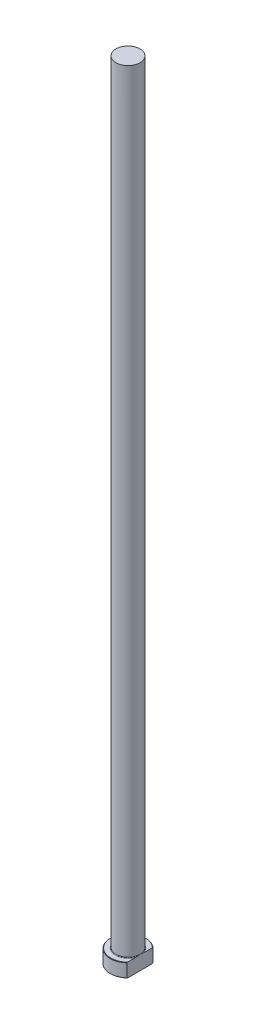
ISO-10303-21;
HEADER;
FILE_DESCRIPTION(('STEP AP214'),'2;1');
FILE_NAME('part.step','',(''),(''),'','','');
FILE_SCHEMA(('AUTOMOTIVE_DESIGN { 1 0 10303 214 1 1 1 1 }'));
ENDSEC;
DATA;
#1=APPLICATION_CONTEXT('core data for automotive mechanical design processes');
#2=APPLICATION_PROTOCOL_DEFINITION('international standard','automotive_design',2000,#1);
#3=PRODUCT_CONTEXT('',#1,'mechanical');
#4=PRODUCT('Part','Part','',(#3));
#5=PRODUCT_RELATED_PRODUCT_CATEGORY('part','',(#4));
#6=PRODUCT_DEFINITION_FORMATION('','',#4);
#7=PRODUCT_DEFINITION_CONTEXT('part definition',#1,'design');
#8=PRODUCT_DEFINITION('design','',#6,#7);
#9=PRODUCT_DEFINITION_SHAPE('','',#8);
#10=(LENGTH_UNIT() NAMED_UNIT(*) SI_UNIT(.MILLI.,.METRE.));
#11=(NAMED_UNIT(*) PLANE_ANGLE_UNIT() SI_UNIT($,.RADIAN.));
#12=(NAMED_UNIT(*) SI_UNIT($,.STERADIAN.) SOLID_ANGLE_UNIT());
#13=UNCERTAINTY_MEASURE_WITH_UNIT(LENGTH_MEASURE(1.E-05),#10,'distance_accuracy_value','');
#14=(GEOMETRIC_REPRESENTATION_CONTEXT(3) GLOBAL_UNCERTAINTY_ASSIGNED_CONTEXT((#13)) GLOBAL_UNIT_ASSIGNED_CONTEXT((#10,
#11,#12)) REPRESENTATION_CONTEXT('',''));
#15=CARTESIAN_POINT('',(0.,0.,0.));
#16=DIRECTION('',(0.,0.,1.));
#17=DIRECTION('',(1.,0.,0.));
#18=AXIS2_PLACEMENT_3D('',#15,#16,#17);
#19=CARTESIAN_POINT('',(0.,0.,0.));
#20=DIRECTION('',(0.,-1.,0.));
#21=DIRECTION('',(0.,0.,-1.));
#22=AXIS2_PLACEMENT_3D('',#19,#20,#21);
#23=PLANE('',#22);
#24=CARTESIAN_POINT('',(0.,0.,0.));
#25=DIRECTION('',(0.,-1.,0.));
#26=DIRECTION('',(0.,0.,-1.));
#27=AXIS2_PLACEMENT_3D('',#24,#25,#26);
#28=CIRCLE('',#27,8.79999999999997);
#29=CARTESIAN_POINT('',(6.09999999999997,0.,6.34271235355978));
#30=VERTEX_POINT('',#29);
#31=CARTESIAN_POINT('',(6.09999999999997,0.,-6.34271235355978));
#32=VERTEX_POINT('',#31);
#33=EDGE_CURVE('E98',#30,#32,#28,.T.);
#34=ORIENTED_EDGE('',*,*,#33,.T.);
#35=DIRECTION('',(0.,0.,1.));
#36=VECTOR('',#35,1.);
#37=CARTESIAN_POINT('',(6.09999999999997,0.,-6.61740130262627));
#38=LINE('',#37,#36);
#39=EDGE_CURVE('E83',#32,#30,#38,.T.);
#40=ORIENTED_EDGE('',*,*,#39,.T.);
#41=EDGE_LOOP('',(#34,#40));
#42=FACE_BOUND('',#41,.T.);
#43=ADVANCED_FACE('F32',(#42),#23,.T.);
#44=CARTESIAN_POINT('',(0.,259.958771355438,0.));
#45=DIRECTION('',(0.,1.,0.));
#46=DIRECTION('',(0.,0.,1.));
#47=AXIS2_PLACEMENT_3D('',#44,#45,#46);
#48=CYLINDRICAL_SURFACE('',#47,8.99999999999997);
#49=CARTESIAN_POINT('',(0.,6.79999999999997,0.));
#50=DIRECTION('',(0.,1.,0.));
#51=DIRECTION('',(0.,0.,1.));
#52=AXIS2_PLACEMENT_3D('',#49,#50,#51);
#53=CIRCLE('',#52,8.99999999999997);
#54=CARTESIAN_POINT('',(6.09999999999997,6.79999999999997,6.61740130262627));
#55=VERTEX_POINT('',#54);
#56=CARTESIAN_POINT('',(6.09999999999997,6.79999999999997,-6.61740130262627));
#57=VERTEX_POINT('',#56);
#58=EDGE_CURVE('E104',#55,#57,#53,.F.);
#59=ORIENTED_EDGE('',*,*,#58,.T.);
#60=DIRECTION('',(0.,-1.,0.));
#61=VECTOR('',#60,1.);
#62=CARTESIAN_POINT('',(6.09999999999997,400.,-6.61740130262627));
#63=LINE('',#62,#61);
#64=CARTESIAN_POINT('',(6.09999999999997,0.200000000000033,-6.61740130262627));
#65=VERTEX_POINT('',#64);
#66=EDGE_CURVE('E183',#57,#65,#63,.T.);
#67=ORIENTED_EDGE('',*,*,#66,.T.);
#68=CARTESIAN_POINT('',(0.,0.200000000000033,0.));
#69=DIRECTION('',(0.,-1.,0.));
#70=DIRECTION('',(0.,0.,-1.));
#71=AXIS2_PLACEMENT_3D('',#68,#69,#70);
#72=CIRCLE('',#71,8.99999999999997);
#73=CARTESIAN_POINT('',(6.09999999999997,0.200000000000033,6.61740130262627));
#74=VERTEX_POINT('',#73);
#75=EDGE_CURVE('E100',#65,#74,#72,.F.);
#76=ORIENTED_EDGE('',*,*,#75,.T.);
#77=DIRECTION('',(0.,-1.,0.));
#78=VECTOR('',#77,1.);
#79=CARTESIAN_POINT('',(6.09999999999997,400.,6.61740130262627));
#80=LINE('',#79,#78);
#81=EDGE_CURVE('E93',#55,#74,#80,.T.);
#82=ORIENTED_EDGE('',*,*,#81,.F.);
#83=EDGE_LOOP('',(#59,#67,#76,#82));
#84=FACE_BOUND('',#83,.T.);
#85=ADVANCED_FACE('F158',(#84),#48,.T.);
#86=CARTESIAN_POINT('',(-8.99999999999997,7.,0.));
#87=DIRECTION('',(0.,1.,0.));
#88=DIRECTION('',(0.,0.,1.));
#89=AXIS2_PLACEMENT_3D('',#86,#87,#88);
#90=PLANE('',#89);
#91=CARTESIAN_POINT('',(0.,7.,0.));
#92=DIRECTION('',(0.,1.,0.));
#93=DIRECTION('',(0.,0.,1.));
#94=AXIS2_PLACEMENT_3D('',#91,#92,#93);
#95=CIRCLE('',#94,8.79999999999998);
#96=CARTESIAN_POINT('',(6.09999999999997,7.,-6.3427123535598));
#97=VERTEX_POINT('',#96);
#98=CARTESIAN_POINT('',(6.09999999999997,7.,6.3427123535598));
#99=VERTEX_POINT('',#98);
#100=EDGE_CURVE('E178',#97,#99,#95,.T.);
#101=ORIENTED_EDGE('',*,*,#100,.T.);
#102=DIRECTION('',(0.,0.,-1.));
#103=VECTOR('',#102,1.);
#104=CARTESIAN_POINT('',(6.09999999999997,7.,0.));
#105=LINE('',#104,#103);
#106=CARTESIAN_POINT('',(6.09999999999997,6.99999999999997,1.9364916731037));
#107=VERTEX_POINT('',#106);
#108=EDGE_CURVE('E57',#99,#107,#105,.T.);
#109=ORIENTED_EDGE('',*,*,#108,.T.);
#110=CARTESIAN_POINT('',(0.,7.,0.));
#111=DIRECTION('',(0.,1.,0.));
#112=DIRECTION('',(0.,0.,1.));
#113=AXIS2_PLACEMENT_3D('',#110,#111,#112);
#114=CIRCLE('',#113,6.39999999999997);
#115=CARTESIAN_POINT('',(6.09999999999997,6.99999999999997,-1.9364916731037));
#116=VERTEX_POINT('',#115);
#117=EDGE_CURVE('E107',#107,#116,#114,.F.);
#118=ORIENTED_EDGE('',*,*,#117,.T.);
#119=EDGE_CURVE('E136',#116,#97,#105,.T.);
#120=ORIENTED_EDGE('',*,*,#119,.T.);
#121=EDGE_LOOP('',(#101,#109,#118,#120));
#122=FACE_BOUND('',#121,.T.);
#123=ADVANCED_FACE('F147',(#122),#90,.T.);
#124=CARTESIAN_POINT('',(0.,7.00000000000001,0.));
#125=DIRECTION('',(0.,-1.,0.));
#126=DIRECTION('',(0.,0.,-1.));
#127=AXIS2_PLACEMENT_3D('',#124,#125,#126);
#128=CONICAL_SURFACE('',#127,8.79999999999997,0.785398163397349);
#129=ORIENTED_EDGE('',*,*,#58,.F.);
#130=CARTESIAN_POINT('',(6.09999999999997,0.014379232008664,14.5593895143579));
#131=CARTESIAN_POINT('',(6.09999999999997,0.214324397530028,14.3426005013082));
#132=CARTESIAN_POINT('',(6.09999999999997,0.413913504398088,14.125483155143));
#133=CARTESIAN_POINT('',(6.09999999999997,0.812271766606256,13.6904946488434));
#134=CARTESIAN_POINT('',(6.09999999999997,1.01104091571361,13.4726234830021));
#135=CARTESIAN_POINT('',(6.09999999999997,1.60603894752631,12.817642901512));
#136=CARTESIAN_POINT('',(6.09999999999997,2.00087078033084,12.3792612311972));
#137=CARTESIAN_POINT('',(6.09999999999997,2.78792222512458,11.4954287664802));
#138=CARTESIAN_POINT('',(6.09999999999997,3.18011200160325,11.049951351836));
#139=CARTESIAN_POINT('',(6.09999999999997,3.95753447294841,10.1530375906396));
#140=CARTESIAN_POINT('',(6.09999999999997,4.3427679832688,9.70160195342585));
#141=CARTESIAN_POINT('',(6.09999999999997,5.03085646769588,8.87725822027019));
#142=CARTESIAN_POINT('',(6.09999999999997,5.33541849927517,8.50578180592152));
#143=CARTESIAN_POINT('',(6.09999999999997,5.78551221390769,7.94308202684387));
#144=CARTESIAN_POINT('',(6.09999999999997,5.93443884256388,7.75457459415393));
#145=CARTESIAN_POINT('',(6.09999999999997,6.22957503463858,7.37544710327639));
#146=CARTESIAN_POINT('',(6.09999999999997,6.37578465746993,7.18482709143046));
#147=CARTESIAN_POINT('',(6.09999999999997,6.66478900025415,6.80131984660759));
#148=CARTESIAN_POINT('',(6.09999999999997,6.80758709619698,6.60843516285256));
#149=CARTESIAN_POINT('',(6.09999999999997,7.08920912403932,6.21979246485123));
#150=CARTESIAN_POINT('',(6.09999999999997,7.22803324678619,6.02403458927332));
#151=CARTESIAN_POINT('',(6.09999999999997,7.50074563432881,5.62920968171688));
#152=CARTESIAN_POINT('',(6.09999999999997,7.63463576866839,5.4301439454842));
#153=CARTESIAN_POINT('',(6.09999999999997,7.89632379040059,5.02806147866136));
#154=CARTESIAN_POINT('',(6.09999999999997,8.02412236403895,4.82504519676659));
#155=CARTESIAN_POINT('',(6.09999999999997,8.27075787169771,4.41652900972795));
#156=CARTESIAN_POINT('',(6.09999999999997,8.38967506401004,4.21107783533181));
#157=CARTESIAN_POINT('',(6.09999999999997,8.61801299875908,3.79489291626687));
#158=CARTESIAN_POINT('',(6.09999999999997,8.72743269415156,3.58415859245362));
#159=CARTESIAN_POINT('',(6.09999999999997,8.93404173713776,3.15694629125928));
#160=CARTESIAN_POINT('',(6.09999999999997,9.03124152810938,2.94047341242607));
#161=CARTESIAN_POINT('',(6.09999999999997,9.21017577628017,2.50119284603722));
#162=CARTESIAN_POINT('',(6.09999999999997,9.29191471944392,2.27838701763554));
#163=CARTESIAN_POINT('',(6.09999999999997,9.4203870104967,1.8755185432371));
#164=CARTESIAN_POINT('',(6.09999999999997,9.47086768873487,1.69665770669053));
#165=CARTESIAN_POINT('',(6.09999999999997,9.55795989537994,1.33556522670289));
#166=CARTESIAN_POINT('',(6.09999999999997,9.5945732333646,1.15333402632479));
#167=CARTESIAN_POINT('',(6.09999999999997,9.65210004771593,0.786944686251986));
#168=CARTESIAN_POINT('',(6.09999999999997,9.6730611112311,0.602794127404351));
#169=CARTESIAN_POINT('',(6.09999999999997,9.6983198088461,0.233342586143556));
#170=CARTESIAN_POINT('',(6.09999999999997,9.70261818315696,0.0480416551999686));
#171=CARTESIAN_POINT('',(6.09999999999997,9.69429534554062,-0.322485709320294));
#172=CARTESIAN_POINT('',(6.09999999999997,9.68164564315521,-0.507711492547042));
#173=CARTESIAN_POINT('',(6.09999999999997,9.64009976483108,-0.876317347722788));
#174=CARTESIAN_POINT('',(6.09999999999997,9.61120224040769,-1.05969726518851));
#175=CARTESIAN_POINT('',(6.09999999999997,9.53854055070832,-1.42403078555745));
#176=CARTESIAN_POINT('',(6.09999999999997,9.49473105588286,-1.60497522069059));
#177=CARTESIAN_POINT('',(6.09999999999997,9.39417906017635,-1.9631904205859));
#178=CARTESIAN_POINT('',(6.09999999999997,9.3374362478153,-2.14046109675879));
#179=CARTESIAN_POINT('',(6.09999999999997,9.20325707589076,-2.51852539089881));
#180=CARTESIAN_POINT('',(6.09999999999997,9.12397188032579,-2.71865799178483));
#181=CARTESIAN_POINT('',(6.09999999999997,8.95352574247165,-3.11384323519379));
#182=CARTESIAN_POINT('',(6.09999999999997,8.86235948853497,-3.30889355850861));
#183=CARTESIAN_POINT('',(6.09999999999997,8.67035859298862,-3.69456420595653));
#184=CARTESIAN_POINT('',(6.09999999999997,8.56950736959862,-3.88517621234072));
#185=CARTESIAN_POINT('',(6.09999999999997,8.36017703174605,-4.26210307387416));
#186=CARTESIAN_POINT('',(6.09999999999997,8.25169895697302,-4.44841851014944));
#187=CARTESIAN_POINT('',(6.09999999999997,8.02723055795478,-4.81954803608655));
#188=CARTESIAN_POINT('',(6.09999999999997,7.91116499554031,-5.00431640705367));
#189=CARTESIAN_POINT('',(6.09999999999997,7.67391977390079,-5.3705334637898));
#190=CARTESIAN_POINT('',(6.09999999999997,7.5527399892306,-5.55198206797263));
#191=CARTESIAN_POINT('',(6.09999999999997,7.30632827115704,-5.9118216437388));
#192=CARTESIAN_POINT('',(6.09999999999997,7.18110067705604,-6.09021559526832));
#193=CARTESIAN_POINT('',(6.09999999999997,6.92719024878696,-6.44453156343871));
#194=CARTESIAN_POINT('',(6.09999999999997,6.79850727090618,-6.62045347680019));
#195=CARTESIAN_POINT('',(6.09999999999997,6.40743139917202,-7.14601004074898));
#196=CARTESIAN_POINT('',(6.09999999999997,6.14071269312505,-7.49242581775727));
#197=CARTESIAN_POINT('',(6.09999999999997,5.59909026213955,-8.17880344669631));
#198=CARTESIAN_POINT('',(6.09999999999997,5.32418574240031,-8.51876466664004));
#199=CARTESIAN_POINT('',(6.09999999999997,4.76812622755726,-9.19396082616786));
#200=CARTESIAN_POINT('',(6.09999999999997,4.48696661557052,-9.52919195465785));
#201=CARTESIAN_POINT('',(6.09999999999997,3.92006700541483,-10.1957589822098));
#202=CARTESIAN_POINT('',(6.09999999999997,3.63432692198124,-10.527094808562));
#203=CARTESIAN_POINT('',(6.09999999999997,3.07379660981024,-11.1700382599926));
#204=CARTESIAN_POINT('',(6.09999999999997,2.79918078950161,-11.48179819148));
#205=CARTESIAN_POINT('',(6.09999999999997,2.24738477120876,-12.1030461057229));
#206=CARTESIAN_POINT('',(6.09999999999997,1.97020453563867,-12.412534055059));
#207=CARTESIAN_POINT('',(6.09999999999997,1.41421579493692,-13.0291430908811));
#208=CARTESIAN_POINT('',(6.09999999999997,1.13541061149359,-13.3362671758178));
#209=CARTESIAN_POINT('',(6.09999999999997,0.576091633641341,-13.9489357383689));
#210=CARTESIAN_POINT('',(6.09999999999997,0.295577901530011,-14.2544802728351));
#211=CARTESIAN_POINT('',(6.09999999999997,0.014379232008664,-14.5593895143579));
#212=B_SPLINE_CURVE_WITH_KNOTS('',3,(#130,#131,#132,#133,#134,#135,#136,#137,#138,#139,#140,
#141,#142,#143,#144,#145,#146,#147,#148,#149,#150,#151,#152,#153,#154,#155,#156,#157,#158,#159,
#160,#161,#162,#163,#164,#165,#166,#167,#168,#169,#170,#171,#172,#173,#174,#175,#176,#177,#178,
#179,#180,#181,#182,#183,#184,#185,#186,#187,#188,#189,#190,#191,#192,#193,#194,#195,#196,#197,
#198,#199,#200,#201,#202,#203,#204,#205,#206,#207,#208,#209,#210,#211),.UNSPECIFIED.,.F.,.F.,(4,
2,2,2,2,2,2,2,2,2,2,2,2,2,2,2,2,2,2,2,2,2,2,2,2,2,2,2,2,2,2,2,2,2,2,2,2,2,2,2,4),(0.,
0.884747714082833,1.76950214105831,3.53939834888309,5.31990146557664,7.10019448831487,
8.54118050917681,9.26187437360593,9.982552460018,10.7024850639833,11.4223830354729,
12.1420053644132,12.8615464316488,13.5735035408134,14.2855390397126,14.9969618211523,
15.7081778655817,16.2652530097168,16.8222554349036,17.3775574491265,17.9328347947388,
18.4890467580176,19.0453048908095,19.60326927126,20.1612470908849,20.806558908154,
21.4521602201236,22.0988872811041,22.7455263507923,23.4000191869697,24.0545280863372,
24.708357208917,25.3622135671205,26.673612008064,27.9851381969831,29.2976668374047,
30.6102199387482,31.8565868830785,33.102972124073,34.3473597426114,35.5917022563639),.UNSPECIFIED.);
#213=EDGE_CURVE('E135',#55,#99,#212,.T.);
#214=ORIENTED_EDGE('',*,*,#213,.T.);
#215=ORIENTED_EDGE('',*,*,#100,.F.);
#216=EDGE_CURVE('E127',#97,#57,#212,.T.);
#217=ORIENTED_EDGE('',*,*,#216,.T.);
#218=EDGE_LOOP('',(#129,#214,#215,#217));
#219=FACE_BOUND('',#218,.T.);
#220=ADVANCED_FACE('F143',(#219),#128,.T.);
#221=CARTESIAN_POINT('',(0.,0.200000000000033,0.));
#222=DIRECTION('',(0.,1.,0.));
#223=DIRECTION('',(0.,0.,1.));
#224=AXIS2_PLACEMENT_3D('',#221,#222,#223);
#225=CONICAL_SURFACE('',#224,8.99999999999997,0.785398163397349);
#226=ORIENTED_EDGE('',*,*,#75,.F.);
#227=CARTESIAN_POINT('',(6.09999999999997,6.98562076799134,-14.5593895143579));
#228=CARTESIAN_POINT('',(6.09999999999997,6.78567560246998,-14.3426005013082));
#229=CARTESIAN_POINT('',(6.09999999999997,6.58608649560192,-14.125483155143));
#230=CARTESIAN_POINT('',(6.09999999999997,6.18772823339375,-13.6904946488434));
#231=CARTESIAN_POINT('',(6.09999999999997,5.9889590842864,-13.4726234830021));
#232=CARTESIAN_POINT('',(6.09999999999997,5.3939610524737,-12.817642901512));
#233=CARTESIAN_POINT('',(6.09999999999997,4.99912921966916,-12.3792612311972));
#234=CARTESIAN_POINT('',(6.09999999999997,4.21207777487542,-11.4954287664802));
#235=CARTESIAN_POINT('',(6.09999999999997,3.81988799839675,-11.049951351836));
#236=CARTESIAN_POINT('',(6.09999999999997,3.0424655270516,-10.1530375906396));
#237=CARTESIAN_POINT('',(6.09999999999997,2.6572320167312,-9.70160195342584));
#238=CARTESIAN_POINT('',(6.09999999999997,1.96914353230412,-8.87725822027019));
#239=CARTESIAN_POINT('',(6.09999999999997,1.66458150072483,-8.50578180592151));
#240=CARTESIAN_POINT('',(6.09999999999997,1.2144877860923,-7.94308202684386));
#241=CARTESIAN_POINT('',(6.09999999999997,1.06556115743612,-7.75457459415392));
#242=CARTESIAN_POINT('',(6.09999999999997,0.770424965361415,-7.37544710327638));
#243=CARTESIAN_POINT('',(6.09999999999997,0.624215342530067,-7.18482709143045));
#244=CARTESIAN_POINT('',(6.09999999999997,0.335210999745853,-6.80131984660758));
#245=CARTESIAN_POINT('',(6.09999999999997,0.192412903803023,-6.60843516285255));
#246=CARTESIAN_POINT('',(6.09999999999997,-0.0892091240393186,-6.21979246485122));
#247=CARTESIAN_POINT('',(6.09999999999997,-0.228033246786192,-6.02403458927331));
#248=CARTESIAN_POINT('',(6.09999999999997,-0.500745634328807,-5.62920968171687));
#249=CARTESIAN_POINT('',(6.09999999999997,-0.634635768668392,-5.43014394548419));
#250=CARTESIAN_POINT('',(6.09999999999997,-0.896323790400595,-5.02806147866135));
#251=CARTESIAN_POINT('',(6.09999999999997,-1.02412236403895,-4.82504519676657));
#252=CARTESIAN_POINT('',(6.09999999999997,-1.27075787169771,-4.41652900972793));
#253=CARTESIAN_POINT('',(6.09999999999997,-1.38967506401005,-4.21107783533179));
#254=CARTESIAN_POINT('',(6.09999999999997,-1.61801299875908,-3.79489291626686));
#255=CARTESIAN_POINT('',(6.09999999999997,-1.72743269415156,-3.58415859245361));
#256=CARTESIAN_POINT('',(6.09999999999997,-1.93404173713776,-3.15694629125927));
#257=CARTESIAN_POINT('',(6.09999999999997,-2.03124152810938,-2.94047341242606));
#258=CARTESIAN_POINT('',(6.09999999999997,-2.21017577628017,-2.50119284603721));
#259=CARTESIAN_POINT('',(6.09999999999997,-2.29191471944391,-2.27838701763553));
#260=CARTESIAN_POINT('',(6.09999999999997,-2.42038701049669,-1.87551854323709));
#261=CARTESIAN_POINT('',(6.09999999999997,-2.47086768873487,-1.69665770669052));
#262=CARTESIAN_POINT('',(6.09999999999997,-2.55795989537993,-1.33556522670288));
#263=CARTESIAN_POINT('',(6.09999999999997,-2.5945732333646,-1.15333402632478));
#264=CARTESIAN_POINT('',(6.09999999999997,-2.65210004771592,-0.786944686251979));
#265=CARTESIAN_POINT('',(6.09999999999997,-2.67306111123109,-0.602794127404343));
#266=CARTESIAN_POINT('',(6.09999999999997,-2.69831980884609,-0.233342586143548));
#267=CARTESIAN_POINT('',(6.09999999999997,-2.70261818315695,-0.0480416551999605));
#268=CARTESIAN_POINT('',(6.09999999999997,-2.69429534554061,0.322485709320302));
#269=CARTESIAN_POINT('',(6.09999999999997,-2.68164564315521,0.50771149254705));
#270=CARTESIAN_POINT('',(6.09999999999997,-2.64009976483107,0.876317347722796));
#271=CARTESIAN_POINT('',(6.09999999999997,-2.61120224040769,1.05969726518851));
#272=CARTESIAN_POINT('',(6.09999999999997,-2.53854055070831,1.42403078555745));
#273=CARTESIAN_POINT('',(6.09999999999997,-2.49473105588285,1.60497522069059));
#274=CARTESIAN_POINT('',(6.09999999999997,-2.39417906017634,1.96319042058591));
#275=CARTESIAN_POINT('',(6.09999999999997,-2.33743624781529,2.1404610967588));
#276=CARTESIAN_POINT('',(6.09999999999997,-2.20325707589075,2.51852539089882));
#277=CARTESIAN_POINT('',(6.09999999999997,-2.12397188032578,2.71865799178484));
#278=CARTESIAN_POINT('',(6.09999999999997,-1.95352574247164,3.1138432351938));
#279=CARTESIAN_POINT('',(6.09999999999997,-1.86235948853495,3.30889355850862));
#280=CARTESIAN_POINT('',(6.09999999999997,-1.67035859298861,3.69456420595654));
#281=CARTESIAN_POINT('',(6.09999999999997,-1.56950736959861,3.88517621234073));
#282=CARTESIAN_POINT('',(6.09999999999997,-1.36017703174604,4.26210307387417));
#283=CARTESIAN_POINT('',(6.09999999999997,-1.25169895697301,4.44841851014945));
#284=CARTESIAN_POINT('',(6.09999999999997,-1.02723055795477,4.81954803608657));
#285=CARTESIAN_POINT('',(6.09999999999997,-0.911164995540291,5.00431640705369));
#286=CARTESIAN_POINT('',(6.09999999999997,-0.673919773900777,5.37053346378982));
#287=CARTESIAN_POINT('',(6.09999999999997,-0.552739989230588,5.55198206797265));
#288=CARTESIAN_POINT('',(6.09999999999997,-0.306328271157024,5.91182164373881));
#289=CARTESIAN_POINT('',(6.09999999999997,-0.181100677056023,6.09021559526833));
#290=CARTESIAN_POINT('',(6.09999999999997,0.07280975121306,6.44453156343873));
#291=CARTESIAN_POINT('',(6.09999999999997,0.201492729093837,6.62045347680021));
#292=CARTESIAN_POINT('',(6.09999999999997,0.592568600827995,7.146010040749));
#293=CARTESIAN_POINT('',(6.09999999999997,0.859287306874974,7.49242581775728));
#294=CARTESIAN_POINT('',(6.09999999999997,1.40090973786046,8.17880344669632));
#295=CARTESIAN_POINT('',(6.09999999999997,1.67581425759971,8.51876466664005));
#296=CARTESIAN_POINT('',(6.09999999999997,2.23187377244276,9.19396082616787));
#297=CARTESIAN_POINT('',(6.09999999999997,2.5130333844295,9.52919195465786));
#298=CARTESIAN_POINT('',(6.09999999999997,3.07993299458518,10.1957589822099));
#299=CARTESIAN_POINT('',(6.09999999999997,3.36567307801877,10.527094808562));
#300=CARTESIAN_POINT('',(6.09999999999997,3.92620339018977,11.1700382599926));
#301=CARTESIAN_POINT('',(6.09999999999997,4.20081921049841,11.48179819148));
#302=CARTESIAN_POINT('',(6.09999999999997,4.75261522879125,12.1030461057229));
#303=CARTESIAN_POINT('',(6.09999999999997,5.02979546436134,12.412534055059));
#304=CARTESIAN_POINT('',(6.09999999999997,5.58578420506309,13.0291430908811));
#305=CARTESIAN_POINT('',(6.09999999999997,5.86458938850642,13.3362671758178));
#306=CARTESIAN_POINT('',(6.09999999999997,6.42390836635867,13.9489357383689));
#307=CARTESIAN_POINT('',(6.09999999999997,6.70442209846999,14.2544802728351));
#308=CARTESIAN_POINT('',(6.09999999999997,6.98562076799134,14.5593895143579));
#309=B_SPLINE_CURVE_WITH_KNOTS('',3,(#227,#228,#229,#230,#231,#232,#233,#234,#235,#236,#237,
#238,#239,#240,#241,#242,#243,#244,#245,#246,#247,#248,#249,#250,#251,#252,#253,#254,#255,#256,
#257,#258,#259,#260,#261,#262,#263,#264,#265,#266,#267,#268,#269,#270,#271,#272,#273,#274,#275,
#276,#277,#278,#279,#280,#281,#282,#283,#284,#285,#286,#287,#288,#289,#290,#291,#292,#293,#294,
#295,#296,#297,#298,#299,#300,#301,#302,#303,#304,#305,#306,#307,#308),.UNSPECIFIED.,.F.,.F.,(4,
2,2,2,2,2,2,2,2,2,2,2,2,2,2,2,2,2,2,2,2,2,2,2,2,2,2,2,2,2,2,2,2,2,2,2,2,2,2,2,4),(0.,
0.884747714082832,1.76950214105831,3.53939834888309,5.31990146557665,7.10019448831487,
8.54118050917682,9.26187437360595,9.98255246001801,10.7024850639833,11.4223830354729,
12.1420053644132,12.8615464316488,13.5735035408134,14.2855390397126,14.9969618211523,
15.7081778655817,16.2652530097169,16.8222554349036,17.3775574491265,17.9328347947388,
18.4890467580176,19.0453048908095,19.60326927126,20.1612470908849,20.806558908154,
21.4521602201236,22.0988872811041,22.7455263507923,23.4000191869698,24.0545280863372,
24.708357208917,25.3622135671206,26.673612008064,27.9851381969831,29.2976668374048,
30.6102199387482,31.8565868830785,33.102972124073,34.3473597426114,35.5917022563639),.UNSPECIFIED.);
#310=EDGE_CURVE('E86',#65,#32,#309,.T.);
#311=ORIENTED_EDGE('',*,*,#310,.T.);
#312=ORIENTED_EDGE('',*,*,#33,.F.);
#313=EDGE_CURVE('E89',#30,#74,#309,.T.);
#314=ORIENTED_EDGE('',*,*,#313,.T.);
#315=EDGE_LOOP('',(#226,#311,#312,#314));
#316=FACE_BOUND('',#315,.T.);
#317=ADVANCED_FACE('F97',(#316),#225,.T.);
#318=CARTESIAN_POINT('',(0.,7.29999999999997,0.));
#319=DIRECTION('',(0.,1.,0.));
#320=DIRECTION('',(0.,0.,1.));
#321=AXIS2_PLACEMENT_3D('',#318,#319,#320);
#322=TOROIDAL_SURFACE('',#321,6.39999999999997,0.3);
#323=CARTESIAN_POINT('',(6.09999999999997,7.29999999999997,0.));
#324=CARTESIAN_POINT('',(6.09999999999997,7.30000062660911,-8.49340882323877E-11));
#325=CARTESIAN_POINT('',(6.09999999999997,7.30000125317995,-2.89750604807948E-07));
#326=CARTESIAN_POINT('',(6.09999999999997,7.30000241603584,-1.06233729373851E-06));
#327=CARTESIAN_POINT('',(6.09999999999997,7.30000292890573,-1.56598288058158E-06));
#328=CARTESIAN_POINT('',(6.09999999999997,7.30000401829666,-2.78036834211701E-06));
#329=CARTESIAN_POINT('',(6.09999999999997,7.30000457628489,-3.51079357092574E-06));
#330=CARTESIAN_POINT('',(6.09999999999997,7.30000555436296,-5.00545869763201E-06));
#331=CARTESIAN_POINT('',(6.09999999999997,7.30000597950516,-5.76672403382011E-06));
#332=CARTESIAN_POINT('',(6.09999999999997,7.30000761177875,-8.78783125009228E-06));
#333=CARTESIAN_POINT('',(6.09999999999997,7.30000873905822,-1.10951031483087E-05));
#334=CARTESIAN_POINT('',(6.09999999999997,7.30001054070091,-1.56065756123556E-05));
#335=CARTESIAN_POINT('',(6.09999999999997,7.30001124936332,-1.77975625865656E-05));
#336=CARTESIAN_POINT('',(6.09999999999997,7.3000143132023,-2.72682416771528E-05));
#337=CARTESIAN_POINT('',(6.09999999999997,7.30001667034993,-3.45497120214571E-05));
#338=CARTESIAN_POINT('',(6.09999999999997,7.30002005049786,-4.8163199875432E-05));
#339=CARTESIAN_POINT('',(6.09999999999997,7.30002122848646,-5.44561398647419E-05));
#340=CARTESIAN_POINT('',(6.09999999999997,7.30002994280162,-0.000101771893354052));
#341=CARTESIAN_POINT('',(6.09999999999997,7.30003670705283,-0.000142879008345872));
#342=CARTESIAN_POINT('',(6.09999999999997,7.30006629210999,-0.000306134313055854));
#343=CARTESIAN_POINT('',(6.09999999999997,7.30009435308,-0.000427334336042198));
#344=CARTESIAN_POINT('',(6.09999999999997,7.30020422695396,-0.000909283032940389));
#345=CARTESIAN_POINT('',(6.09999999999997,7.30028277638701,-0.00127051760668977));
#346=CARTESIAN_POINT('',(6.09999999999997,7.30059854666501,-0.00271271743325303));
#347=CARTESIAN_POINT('',(6.09999999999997,7.30083994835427,-0.00379303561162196));
#348=CARTESIAN_POINT('',(6.09999999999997,7.30185162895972,-0.00833170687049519));
#349=CARTESIAN_POINT('',(6.09999999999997,7.30261657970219,-0.0117908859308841));
#350=CARTESIAN_POINT('',(6.09999999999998,7.30941584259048,-0.0425231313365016));
#351=CARTESIAN_POINT('',(6.09999999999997,7.31547175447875,-0.0697929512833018));
#352=CARTESIAN_POINT('',(6.09999999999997,7.32730575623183,-0.123231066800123));
#353=CARTESIAN_POINT('',(6.09999999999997,7.33308513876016,-0.149399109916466));
#354=CARTESIAN_POINT('',(6.09999999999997,7.34535810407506,-0.205120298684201));
#355=CARTESIAN_POINT('',(6.09999999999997,7.35184757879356,-0.234674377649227));
#356=CARTESIAN_POINT('',(6.09999999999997,7.36483397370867,-0.294125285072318));
#357=CARTESIAN_POINT('',(6.09999999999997,7.37133017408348,-0.324022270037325));
#358=CARTESIAN_POINT('',(6.09999999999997,7.3868079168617,-0.39575720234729));
#359=CARTESIAN_POINT('',(6.09999999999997,7.39574786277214,-0.437604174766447));
#360=CARTESIAN_POINT('',(6.09999999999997,7.41315372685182,-0.520210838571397));
#361=CARTESIAN_POINT('',(6.09999999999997,7.42162592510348,-0.560969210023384));
#362=CARTESIAN_POINT('',(6.09999999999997,7.44897438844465,-0.694856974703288));
#363=CARTESIAN_POINT('',(6.09999999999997,7.46725806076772,-0.788109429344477));
#364=CARTESIAN_POINT('',(6.09999999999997,7.50173201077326,-0.975940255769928));
#365=CARTESIAN_POINT('',(6.09999999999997,7.51790033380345,-1.07052272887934));
#366=CARTESIAN_POINT('',(6.09999999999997,7.5483609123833,-1.26941791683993));
#367=CARTESIAN_POINT('',(6.09999999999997,7.56231819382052,-1.37378304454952));
#368=CARTESIAN_POINT('',(6.09999999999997,7.58455179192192,-1.58284720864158));
#369=CARTESIAN_POINT('',(6.09999999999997,7.59284552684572,-1.68754421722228));
#370=CARTESIAN_POINT('',(6.09999999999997,7.59905685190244,-1.84322200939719));
#371=CARTESIAN_POINT('',(6.09999999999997,7.60011923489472,-1.89407517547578));
#372=CARTESIAN_POINT('',(6.09999999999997,7.59985882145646,-1.99583446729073));
#373=CARTESIAN_POINT('',(6.09999999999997,7.59853367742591,-2.04674059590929));
#374=CARTESIAN_POINT('',(6.09999999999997,7.59293461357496,-2.14745109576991));
#375=CARTESIAN_POINT('',(6.09999999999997,7.58871621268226,-2.19725829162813));
#376=CARTESIAN_POINT('',(6.09999999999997,7.57652343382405,-2.29636696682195));
#377=CARTESIAN_POINT('',(6.09999999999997,7.56855424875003,-2.34566904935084));
#378=CARTESIAN_POINT('',(6.09999999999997,7.54906685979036,-2.43557410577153));
#379=CARTESIAN_POINT('',(6.09999999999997,7.53830158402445,-2.47632837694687));
#380=CARTESIAN_POINT('',(6.09999999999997,7.51813116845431,-2.53619759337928));
#381=CARTESIAN_POINT('',(6.09999999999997,7.51071988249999,-2.55597892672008));
#382=CARTESIAN_POINT('',(6.09999999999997,7.49420581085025,-2.59481280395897));
#383=CARTESIAN_POINT('',(6.09999999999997,7.48510530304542,-2.61386628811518));
#384=CARTESIAN_POINT('',(6.09999999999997,7.46462437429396,-2.65097502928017));
#385=CARTESIAN_POINT('',(6.09999999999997,7.4532219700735,-2.66901833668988));
#386=CARTESIAN_POINT('',(6.09999999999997,7.42747894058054,-2.70281743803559));
#387=CARTESIAN_POINT('',(6.09999999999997,7.41316603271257,-2.71859257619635));
#388=CARTESIAN_POINT('',(6.09999999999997,7.39059237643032,-2.73744251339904));
#389=CARTESIAN_POINT('',(6.09999999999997,7.38392912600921,-2.74241546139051));
#390=CARTESIAN_POINT('',(6.09999999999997,7.36998483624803,-2.75142973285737));
#391=CARTESIAN_POINT('',(6.09999999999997,7.36270362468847,-2.75547079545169));
#392=CARTESIAN_POINT('',(6.09999999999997,7.34749053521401,-2.76237207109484));
#393=CARTESIAN_POINT('',(6.09999999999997,7.33955232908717,-2.76521867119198));
#394=CARTESIAN_POINT('',(6.09999999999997,7.3232826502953,-2.76936266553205));
#395=CARTESIAN_POINT('',(6.09999999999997,7.3149518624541,-2.7706626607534));
#396=CARTESIAN_POINT('',(6.09999999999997,7.29896440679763,-2.77151083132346));
#397=CARTESIAN_POINT('',(6.09999999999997,7.29131555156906,-2.77120796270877));
#398=CARTESIAN_POINT('',(6.09999999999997,7.27619804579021,-2.76922646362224));
#399=CARTESIAN_POINT('',(6.09999999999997,7.26872952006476,-2.76754690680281));
#400=CARTESIAN_POINT('',(6.09999999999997,7.25296547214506,-2.76260061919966));
#401=CARTESIAN_POINT('',(6.09999999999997,7.24473928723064,-2.75911619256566));
#402=CARTESIAN_POINT('',(6.09999999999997,7.22896148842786,-2.75086515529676));
#403=CARTESIAN_POINT('',(6.09999999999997,7.22141106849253,-2.74609633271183));
#404=CARTESIAN_POINT('',(6.09999999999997,7.20301227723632,-2.73270182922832));
#405=CARTESIAN_POINT('',(6.09999999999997,7.1926580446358,-2.72340416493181));
#406=CARTESIAN_POINT('',(6.09999999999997,7.1734395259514,-2.70338710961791));
#407=CARTESIAN_POINT('',(6.09999999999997,7.1645795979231,-2.69266371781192));
#408=CARTESIAN_POINT('',(6.09999999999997,7.14025540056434,-2.65971164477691));
#409=CARTESIAN_POINT('',(6.09999999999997,7.12651072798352,-2.63622875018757));
#410=CARTESIAN_POINT('',(6.09999999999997,7.10227969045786,-2.58772082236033));
#411=CARTESIAN_POINT('',(6.09999999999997,7.09179747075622,-2.56269387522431));
#412=CARTESIAN_POINT('',(6.09999999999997,7.0688846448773,-2.49991766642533));
#413=CARTESIAN_POINT('',(6.09999999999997,7.05782215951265,-2.46167427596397));
#414=CARTESIAN_POINT('',(6.09999999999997,7.03925041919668,-2.38430824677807));
#415=CARTESIAN_POINT('',(6.09999999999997,7.03174899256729,-2.34518386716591));
#416=CARTESIAN_POINT('',(6.09999999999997,7.01934937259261,-2.26583226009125));
#417=CARTESIAN_POINT('',(6.09999999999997,7.01449904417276,-2.22559771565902));
#418=CARTESIAN_POINT('',(6.09999999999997,7.00701943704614,-2.14499086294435));
#419=CARTESIAN_POINT('',(6.09999999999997,7.00438710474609,-2.10461882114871));
#420=CARTESIAN_POINT('',(6.09999999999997,6.99952969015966,-1.99154987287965));
#421=CARTESIAN_POINT('',(6.09999999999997,6.99930606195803,-1.91876811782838));
#422=CARTESIAN_POINT('',(6.09999999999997,7.00309053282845,-1.77330138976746));
#423=CARTESIAN_POINT('',(6.09999999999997,7.00710151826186,-1.70061651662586));
#424=CARTESIAN_POINT('',(6.09999999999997,7.01839350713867,-1.55515240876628));
#425=CARTESIAN_POINT('',(6.09999999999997,7.02569039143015,-1.4823744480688));
#426=CARTESIAN_POINT('',(6.09999999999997,7.0428282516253,-1.33711517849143));
#427=CARTESIAN_POINT('',(6.09999999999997,7.05266964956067,-1.2646339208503));
#428=CARTESIAN_POINT('',(6.09999999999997,7.08305970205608,-1.06158751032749));
#429=CARTESIAN_POINT('',(6.09999999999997,7.1058392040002,-0.931360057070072));
#430=CARTESIAN_POINT('',(6.09999999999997,7.15498382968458,-0.6732160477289));
#431=CARTESIAN_POINT('',(6.09999999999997,7.18130321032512,-0.545290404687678));
#432=CARTESIAN_POINT('',(6.09999999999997,7.2144838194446,-0.38980494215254));
#433=CARTESIAN_POINT('',(6.09999999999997,7.22045276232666,-0.362051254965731));
#434=CARTESIAN_POINT('',(6.09999999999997,7.23263801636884,-0.305748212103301));
#435=CARTESIAN_POINT('',(6.09999999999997,7.2388564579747,-0.277199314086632));
#436=CARTESIAN_POINT('',(6.09999999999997,7.25406223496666,-0.207696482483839));
#437=CARTESIAN_POINT('',(6.09999999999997,7.26307730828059,-0.166748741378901));
#438=CARTESIAN_POINT('',(6.09999999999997,7.28028241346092,-0.0889531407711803));
#439=CARTESIAN_POINT('',(6.09999999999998,7.28846503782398,-0.052103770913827));
#440=CARTESIAN_POINT('',(6.09999999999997,7.29738224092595,-0.0117959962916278));
#441=CARTESIAN_POINT('',(6.09999999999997,7.2981461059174,-0.00834194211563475));
#442=CARTESIAN_POINT('',(6.09999999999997,7.29915753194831,-0.0038044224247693));
#443=CARTESIAN_POINT('',(6.09999999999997,7.29939981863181,-0.00272013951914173));
#444=CARTESIAN_POINT('',(6.09999999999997,7.29971666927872,-0.00127300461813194));
#445=CARTESIAN_POINT('',(6.09999999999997,7.29979542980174,-0.000910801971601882));
#446=CARTESIAN_POINT('',(6.09999999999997,7.29990555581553,-0.000427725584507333));
#447=CARTESIAN_POINT('',(6.09999999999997,7.29993365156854,-0.000306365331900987));
#448=CARTESIAN_POINT('',(6.09999999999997,7.29996326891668,-0.000142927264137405));
#449=CARTESIAN_POINT('',(6.09999999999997,7.29997003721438,-0.000101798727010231));
#450=CARTESIAN_POINT('',(6.09999999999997,7.29997875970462,-5.44609821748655E-05));
#451=CARTESIAN_POINT('',(6.09999999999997,7.29997993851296,-4.81669455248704E-05));
#452=CARTESIAN_POINT('',(6.09999999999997,7.29998332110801,-3.45511307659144E-05));
#453=CARTESIAN_POINT('',(6.09999999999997,7.29998568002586,-2.726848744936E-05));
#454=CARTESIAN_POINT('',(6.09999999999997,7.2999887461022,-1.77965710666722E-05));
#455=CARTESIAN_POINT('',(6.09999999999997,7.29998945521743,-1.5605504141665E-05));
#456=CARTESIAN_POINT('',(6.09999999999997,7.29999125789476,-1.10939383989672E-05));
#457=CARTESIAN_POINT('',(6.09999999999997,7.29999238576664,-8.78666464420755E-06));
#458=CARTESIAN_POINT('',(6.09999999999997,7.29999401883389,-5.76563104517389E-06));
#459=CARTESIAN_POINT('',(6.09999999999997,7.2999944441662,-5.00441018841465E-06));
#460=CARTESIAN_POINT('',(6.09999999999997,7.29999542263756,-3.50986831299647E-06));
#461=CARTESIAN_POINT('',(6.09999999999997,7.29999598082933,-2.77952359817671E-06));
#462=CARTESIAN_POINT('',(6.09999999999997,7.29999707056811,-1.56532290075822E-06));
#463=CARTESIAN_POINT('',(6.09999999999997,7.29999758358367,-1.06177376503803E-06));
#464=CARTESIAN_POINT('',(6.09999999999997,7.29999874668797,-2.89436475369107E-07));
#465=CARTESIAN_POINT('',(6.09999999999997,7.29999937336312,8.49378445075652E-11));
#466=CARTESIAN_POINT('',(6.09999999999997,7.29999999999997,0.));
#467=B_SPLINE_CURVE_WITH_KNOTS('',3,(#323,#324,#325,#326,#327,#328,#329,#330,#331,#332,#333,
#334,#335,#336,#337,#338,#339,#340,#341,#342,#343,#344,#345,#346,#347,#348,#349,#350,#351,#352,
#353,#354,#355,#356,#357,#358,#359,#360,#361,#362,#363,#364,#365,#366,#367,#368,#369,#370,#371,
#372,#373,#374,#375,#376,#377,#378,#379,#380,#381,#382,#383,#384,#385,#386,#387,#388,#389,#390,
#391,#392,#393,#394,#395,#396,#397,#398,#399,#400,#401,#402,#403,#404,#405,#406,#407,#408,#409,
#410,#411,#412,#413,#414,#415,#416,#417,#418,#419,#420,#421,#422,#423,#424,#425,#426,#427,#428,
#429,#430,#431,#432,#433,#434,#435,#436,#437,#438,#439,#440,#441,#442,#443,#444,#445,#446,#447,
#448,#449,#450,#451,#452,#453,#454,#455,#456,#457,#458,#459,#460,#461,#462,#463,#464,#465,#466),
.UNSPECIFIED.,.T.,.F.,(4,2,2,2,2,2,2,2,2,2,2,2,2,2,2,2,2,2,2,2,2,2,2,2,2,2,2,2,2,2,2,2,2,2,2,2,
2,2,2,2,2,2,2,2,2,2,2,2,2,2,2,2,2,2,2,2,2,2,2,2,2,2,2,2,2,2,2,2,2,2,2,4),(0.,
1.91250960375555E-06,4.08178522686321E-06,6.8194531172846E-06,9.4346481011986E-06,
1.71137963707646E-05,2.40155063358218E-05,4.6944459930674E-05,6.61299340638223E-05,
0.000191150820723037,0.00056409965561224,0.00167341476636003,0.00499394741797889,
0.015622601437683,0.0994231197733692,0.179819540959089,0.270593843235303,0.362377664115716,
0.49075076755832,0.6156392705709,0.900704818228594,1.18852716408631,1.50431807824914,
1.81913334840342,1.97168386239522,2.12438445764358,2.27423396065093,2.4238766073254,
2.55004267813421,2.61335958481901,2.67659172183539,2.74045901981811,2.80374440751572,
2.82862908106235,2.85352071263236,2.87868879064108,2.90381448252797,2.92664866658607,
2.94949822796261,2.97615207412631,3.00285211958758,3.04436429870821,3.0859955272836,
3.16716680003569,3.24844079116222,3.36758630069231,3.48699253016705,3.60848882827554,
3.72981758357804,3.94797165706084,4.16627452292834,4.38564396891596,4.60504982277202,
5.00154620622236,5.3933388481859,5.47850384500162,5.56615847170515,5.69194439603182,
5.80518254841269,5.81579547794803,5.81912819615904,5.82024048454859,5.82061392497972,
5.82073901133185,5.82075820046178,5.82078113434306,5.82078803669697,5.82079571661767,
5.82079833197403,5.820801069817,5.82080323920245,5.82080515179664),.UNSPECIFIED.);
#468=CARTESIAN_POINT('',(6.09999999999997,7.29999999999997,0.));
#469=VERTEX_POINT('',#468);
#470=EDGE_CURVE('E11',#116,#469,#467,.T.);
#471=ORIENTED_EDGE('',*,*,#470,.F.);
#472=ORIENTED_EDGE('',*,*,#117,.F.);
#473=CARTESIAN_POINT('',(6.09999999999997,7.29999999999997,0.));
#474=CARTESIAN_POINT('',(6.09999999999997,7.29999937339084,8.49339302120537E-11));
#475=CARTESIAN_POINT('',(6.09999999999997,7.29999874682,2.89750604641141E-07));
#476=CARTESIAN_POINT('',(6.09999999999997,7.29999758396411,1.06233729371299E-06));
#477=CARTESIAN_POINT('',(6.09999999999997,7.29999707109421,1.56598288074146E-06));
#478=CARTESIAN_POINT('',(6.09999999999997,7.29999598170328,2.78036834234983E-06));
#479=CARTESIAN_POINT('',(6.09999999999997,7.29999542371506,3.51079357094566E-06));
#480=CARTESIAN_POINT('',(6.09999999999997,7.29999444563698,5.00545869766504E-06));
#481=CARTESIAN_POINT('',(6.09999999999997,7.29999402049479,5.76672403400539E-06));
#482=CARTESIAN_POINT('',(6.09999999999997,7.2999923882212,8.78783125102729E-06));
#483=CARTESIAN_POINT('',(6.09999999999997,7.29999126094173,1.10951031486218E-05));
#484=CARTESIAN_POINT('',(6.09999999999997,7.29998945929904,1.56065756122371E-05));
#485=CARTESIAN_POINT('',(6.09999999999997,7.29998875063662,1.77975625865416E-05));
#486=CARTESIAN_POINT('',(6.09999999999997,7.29998568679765,2.72682416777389E-05));
#487=CARTESIAN_POINT('',(6.09999999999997,7.29998332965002,3.45497120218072E-05));
#488=CARTESIAN_POINT('',(6.09999999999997,7.29997994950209,4.81631998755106E-05));
#489=CARTESIAN_POINT('',(6.09999999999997,7.29997877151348,5.44561398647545E-05));
#490=CARTESIAN_POINT('',(6.09999999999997,7.29997005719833,0.000101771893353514));
#491=CARTESIAN_POINT('',(6.09999999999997,7.29996329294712,0.000142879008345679));
#492=CARTESIAN_POINT('',(6.09999999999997,7.29993370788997,0.000306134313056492));
#493=CARTESIAN_POINT('',(6.09999999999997,7.29990564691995,0.000427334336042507));
#494=CARTESIAN_POINT('',(6.09999999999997,7.29979577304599,0.000909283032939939));
#495=CARTESIAN_POINT('',(6.09999999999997,7.29971722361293,0.00127051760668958));
#496=CARTESIAN_POINT('',(6.09999999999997,7.29940145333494,0.00271271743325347));
#497=CARTESIAN_POINT('',(6.09999999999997,7.29916005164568,0.00379303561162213));
#498=CARTESIAN_POINT('',(6.09999999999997,7.29814837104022,0.00833170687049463));
#499=CARTESIAN_POINT('',(6.09999999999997,7.29738342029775,0.0117908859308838));
#500=CARTESIAN_POINT('',(6.09999999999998,7.29058415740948,0.0425231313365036));
#501=CARTESIAN_POINT('',(6.09999999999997,7.2845282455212,0.0697929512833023));
#502=CARTESIAN_POINT('',(6.09999999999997,7.27269424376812,0.123231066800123));
#503=CARTESIAN_POINT('',(6.09999999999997,7.26691486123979,0.149399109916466));
#504=CARTESIAN_POINT('',(6.09999999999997,7.25464189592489,0.205120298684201));
#505=CARTESIAN_POINT('',(6.09999999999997,7.24815242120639,0.234674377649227));
#506=CARTESIAN_POINT('',(6.09999999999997,7.23516602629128,0.294125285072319));
#507=CARTESIAN_POINT('',(6.09999999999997,7.22866982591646,0.324022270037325));
#508=CARTESIAN_POINT('',(6.09999999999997,7.21319208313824,0.39575720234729));
#509=CARTESIAN_POINT('',(6.09999999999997,7.2042521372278,0.437604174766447));
#510=CARTESIAN_POINT('',(6.09999999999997,7.18684627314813,0.520210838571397));
#511=CARTESIAN_POINT('',(6.09999999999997,7.17837407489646,0.560969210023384));
#512=CARTESIAN_POINT('',(6.09999999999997,7.1510256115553,0.694856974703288));
#513=CARTESIAN_POINT('',(6.09999999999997,7.13274193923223,0.788109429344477));
#514=CARTESIAN_POINT('',(6.09999999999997,7.09826798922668,0.975940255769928));
#515=CARTESIAN_POINT('',(6.09999999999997,7.0820996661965,1.07052272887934));
#516=CARTESIAN_POINT('',(6.09999999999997,7.05163908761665,1.26941791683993));
#517=CARTESIAN_POINT('',(6.09999999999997,7.03768180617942,1.37378304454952));
#518=CARTESIAN_POINT('',(6.09999999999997,7.01544820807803,1.58284720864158));
#519=CARTESIAN_POINT('',(6.09999999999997,7.00715447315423,1.68754421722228));
#520=CARTESIAN_POINT('',(6.09999999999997,7.0009431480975,1.84322200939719));
#521=CARTESIAN_POINT('',(6.09999999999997,6.99988076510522,1.89407517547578));
#522=CARTESIAN_POINT('',(6.09999999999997,7.00014117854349,1.99583446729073));
#523=CARTESIAN_POINT('',(6.09999999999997,7.00146632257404,2.04674059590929));
#524=CARTESIAN_POINT('',(6.09999999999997,7.00706538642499,2.14745109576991));
#525=CARTESIAN_POINT('',(6.09999999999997,7.01128378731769,2.19725829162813));
#526=CARTESIAN_POINT('',(6.09999999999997,7.0234765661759,2.29636696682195));
#527=CARTESIAN_POINT('',(6.09999999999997,7.03144575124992,2.34566904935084));
#528=CARTESIAN_POINT('',(6.09999999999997,7.05093314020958,2.43557410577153));
#529=CARTESIAN_POINT('',(6.09999999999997,7.06169841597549,2.47632837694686));
#530=CARTESIAN_POINT('',(6.09999999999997,7.08186883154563,2.53619759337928));
#531=CARTESIAN_POINT('',(6.09999999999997,7.08928011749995,2.55597892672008));
#532=CARTESIAN_POINT('',(6.09999999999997,7.1057941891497,2.59481280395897));
#533=CARTESIAN_POINT('',(6.09999999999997,7.11489469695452,2.61386628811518));
#534=CARTESIAN_POINT('',(6.09999999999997,7.13537562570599,2.65097502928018));
#535=CARTESIAN_POINT('',(6.09999999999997,7.14677802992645,2.66901833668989));
#536=CARTESIAN_POINT('',(6.09999999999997,7.17252105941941,2.70281743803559));
#537=CARTESIAN_POINT('',(6.09999999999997,7.18683396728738,2.71859257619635));
#538=CARTESIAN_POINT('',(6.09999999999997,7.20940762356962,2.73744251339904));
#539=CARTESIAN_POINT('',(6.09999999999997,7.21607087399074,2.74241546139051));
#540=CARTESIAN_POINT('',(6.09999999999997,7.23001516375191,2.75142973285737));
#541=CARTESIAN_POINT('',(6.09999999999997,7.23729637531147,2.75547079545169));
#542=CARTESIAN_POINT('',(6.09999999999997,7.25250946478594,2.76237207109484));
#543=CARTESIAN_POINT('',(6.09999999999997,7.26044767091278,2.76521867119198));
#544=CARTESIAN_POINT('',(6.09999999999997,7.27671734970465,2.76936266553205));
#545=CARTESIAN_POINT('',(6.09999999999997,7.28504813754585,2.7706626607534));
#546=CARTESIAN_POINT('',(6.09999999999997,7.30103559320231,2.77151083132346));
#547=CARTESIAN_POINT('',(6.09999999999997,7.30868444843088,2.77120796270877));
#548=CARTESIAN_POINT('',(6.09999999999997,7.32380195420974,2.76922646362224));
#549=CARTESIAN_POINT('',(6.09999999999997,7.33127047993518,2.76754690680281));
#550=CARTESIAN_POINT('',(6.09999999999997,7.34703452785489,2.76260061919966));
#551=CARTESIAN_POINT('',(6.09999999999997,7.35526071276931,2.75911619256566));
#552=CARTESIAN_POINT('',(6.09999999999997,7.37103851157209,2.75086515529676));
#553=CARTESIAN_POINT('',(6.09999999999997,7.37858893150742,2.74609633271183));
#554=CARTESIAN_POINT('',(6.09999999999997,7.39698772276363,2.73270182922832));
#555=CARTESIAN_POINT('',(6.09999999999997,7.40734195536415,2.72340416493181));
#556=CARTESIAN_POINT('',(6.09999999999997,7.42656047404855,2.70338710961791));
#557=CARTESIAN_POINT('',(6.09999999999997,7.43542040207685,2.69266371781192));
#558=CARTESIAN_POINT('',(6.09999999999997,7.45974459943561,2.65971164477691));
#559=CARTESIAN_POINT('',(6.09999999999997,7.47348927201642,2.63622875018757));
#560=CARTESIAN_POINT('',(6.09999999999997,7.49772030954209,2.58772082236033));
#561=CARTESIAN_POINT('',(6.09999999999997,7.50820252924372,2.56269387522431));
#562=CARTESIAN_POINT('',(6.09999999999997,7.53111535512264,2.49991766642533));
#563=CARTESIAN_POINT('',(6.09999999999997,7.54217784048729,2.46167427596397));
#564=CARTESIAN_POINT('',(6.09999999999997,7.56074958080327,2.38430824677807));
#565=CARTESIAN_POINT('',(6.09999999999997,7.56825100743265,2.34518386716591));
#566=CARTESIAN_POINT('',(6.09999999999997,7.58065062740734,2.26583226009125));
#567=CARTESIAN_POINT('',(6.09999999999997,7.58550095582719,2.22559771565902));
#568=CARTESIAN_POINT('',(6.09999999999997,7.59298056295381,2.14499086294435));
#569=CARTESIAN_POINT('',(6.09999999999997,7.59561289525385,2.10461882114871));
#570=CARTESIAN_POINT('',(6.09999999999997,7.60047030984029,1.99154987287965));
#571=CARTESIAN_POINT('',(6.09999999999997,7.60069393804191,1.91876811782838));
#572=CARTESIAN_POINT('',(6.09999999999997,7.59690946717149,1.77330138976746));
#573=CARTESIAN_POINT('',(6.09999999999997,7.59289848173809,1.70061651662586));
#574=CARTESIAN_POINT('',(6.09999999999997,7.58160649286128,1.55515240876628));
#575=CARTESIAN_POINT('',(6.09999999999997,7.5743096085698,1.4823744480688));
#576=CARTESIAN_POINT('',(6.09999999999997,7.55717174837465,1.33711517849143));
#577=CARTESIAN_POINT('',(6.09999999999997,7.54733035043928,1.2646339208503));
#578=CARTESIAN_POINT('',(6.09999999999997,7.51694029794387,1.06158751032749));
#579=CARTESIAN_POINT('',(6.09999999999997,7.49416079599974,0.931360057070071));
#580=CARTESIAN_POINT('',(6.09999999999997,7.44501617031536,0.673216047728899));
#581=CARTESIAN_POINT('',(6.09999999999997,7.41869678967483,0.545290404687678));
#582=CARTESIAN_POINT('',(6.09999999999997,7.38551618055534,0.38980494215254));
#583=CARTESIAN_POINT('',(6.09999999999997,7.37954723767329,0.362051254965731));
#584=CARTESIAN_POINT('',(6.09999999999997,7.36736198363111,0.305748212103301));
#585=CARTESIAN_POINT('',(6.09999999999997,7.36114354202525,0.277199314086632));
#586=CARTESIAN_POINT('',(6.09999999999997,7.34593776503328,0.20769648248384));
#587=CARTESIAN_POINT('',(6.09999999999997,7.33692269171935,0.166748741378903));
#588=CARTESIAN_POINT('',(6.09999999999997,7.31971758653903,0.0889531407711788));
#589=CARTESIAN_POINT('',(6.09999999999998,7.31153496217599,0.0521037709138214));
#590=CARTESIAN_POINT('',(6.09999999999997,7.302617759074,0.0117959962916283));
#591=CARTESIAN_POINT('',(6.09999999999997,7.30185389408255,0.00834194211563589));
#592=CARTESIAN_POINT('',(6.09999999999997,7.30084246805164,0.00380442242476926));
#593=CARTESIAN_POINT('',(6.09999999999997,7.30060018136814,0.00272013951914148));
#594=CARTESIAN_POINT('',(6.09999999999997,7.30028333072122,0.00127300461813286));
#595=CARTESIAN_POINT('',(6.09999999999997,7.30020457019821,0.000910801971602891));
#596=CARTESIAN_POINT('',(6.09999999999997,7.30009444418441,0.000427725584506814));
#597=CARTESIAN_POINT('',(6.09999999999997,7.30006634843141,0.000306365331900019));
#598=CARTESIAN_POINT('',(6.09999999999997,7.30003673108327,0.000142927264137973));
#599=CARTESIAN_POINT('',(6.09999999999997,7.30002996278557,0.000101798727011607));
#600=CARTESIAN_POINT('',(6.09999999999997,7.30002124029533,5.44609821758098E-05));
#601=CARTESIAN_POINT('',(6.09999999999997,7.30002006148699,4.81669455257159E-05));
#602=CARTESIAN_POINT('',(6.09999999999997,7.30001667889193,3.45511307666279E-05));
#603=CARTESIAN_POINT('',(6.09999999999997,7.30001431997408,2.72684874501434E-05));
#604=CARTESIAN_POINT('',(6.09999999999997,7.30001125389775,1.77965710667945E-05));
#605=CARTESIAN_POINT('',(6.09999999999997,7.30001054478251,1.5605504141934E-05));
#606=CARTESIAN_POINT('',(6.09999999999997,7.30000874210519,1.10939383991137E-05));
#607=CARTESIAN_POINT('',(6.09999999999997,7.30000761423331,8.78666464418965E-06));
#608=CARTESIAN_POINT('',(6.09999999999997,7.30000598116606,5.76563104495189E-06));
#609=CARTESIAN_POINT('',(6.09999999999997,7.30000555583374,5.00441018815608E-06));
#610=CARTESIAN_POINT('',(6.09999999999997,7.30000457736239,3.50986831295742E-06));
#611=CARTESIAN_POINT('',(6.09999999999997,7.30000401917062,2.77952359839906E-06));
#612=CARTESIAN_POINT('',(6.09999999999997,7.30000292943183,1.56532290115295E-06));
#613=CARTESIAN_POINT('',(6.09999999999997,7.30000241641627,1.06177376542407E-06));
#614=CARTESIAN_POINT('',(6.09999999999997,7.30000125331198,2.8943647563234E-07));
#615=CARTESIAN_POINT('',(6.09999999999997,7.30000062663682,-8.49376864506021E-11));
#616=CARTESIAN_POINT('',(6.09999999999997,7.29999999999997,0.));
#617=B_SPLINE_CURVE_WITH_KNOTS('',3,(#473,#474,#475,#476,#477,#478,#479,#480,#481,#482,#483,
#484,#485,#486,#487,#488,#489,#490,#491,#492,#493,#494,#495,#496,#497,#498,#499,#500,#501,#502,
#503,#504,#505,#506,#507,#508,#509,#510,#511,#512,#513,#514,#515,#516,#517,#518,#519,#520,#521,
#522,#523,#524,#525,#526,#527,#528,#529,#530,#531,#532,#533,#534,#535,#536,#537,#538,#539,#540,
#541,#542,#543,#544,#545,#546,#547,#548,#549,#550,#551,#552,#553,#554,#555,#556,#557,#558,#559,
#560,#561,#562,#563,#564,#565,#566,#567,#568,#569,#570,#571,#572,#573,#574,#575,#576,#577,#578,
#579,#580,#581,#582,#583,#584,#585,#586,#587,#588,#589,#590,#591,#592,#593,#594,#595,#596,#597,
#598,#599,#600,#601,#602,#603,#604,#605,#606,#607,#608,#609,#610,#611,#612,#613,#614,#615,#616),
.UNSPECIFIED.,.T.,.F.,(4,2,2,2,2,2,2,2,2,2,2,2,2,2,2,2,2,2,2,2,2,2,2,2,2,2,2,2,2,2,2,2,2,2,2,2,
2,2,2,2,2,2,2,2,2,2,2,2,2,2,2,2,2,2,2,2,2,2,2,2,2,2,2,2,2,2,2,2,2,2,2,4),(0.,
1.91250960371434E-06,4.08178522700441E-06,6.81945311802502E-06,9.43464810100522E-06,
1.71137963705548E-05,2.40155063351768E-05,4.69444599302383E-05,6.61299340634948E-05,
0.00019115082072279,0.000564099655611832,0.00167341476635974,0.0049939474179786,
0.0156226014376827,0.0994231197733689,0.179819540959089,0.270593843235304,0.362377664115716,
0.49075076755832,0.615639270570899,0.900704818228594,1.18852716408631,1.50431807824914,
1.81913334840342,1.97168386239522,2.12438445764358,2.27423396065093,2.4238766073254,
2.5500426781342,2.61335958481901,2.67659172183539,2.74045901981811,2.80374440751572,
2.82862908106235,2.85352071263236,2.87868879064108,2.90381448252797,2.92664866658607,
2.94949822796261,2.97615207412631,3.00285211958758,3.04436429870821,3.0859955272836,
3.16716680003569,3.24844079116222,3.36758630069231,3.48699253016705,3.60848882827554,
3.72981758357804,3.94797165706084,4.16627452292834,4.38564396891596,4.60504982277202,
5.00154620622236,5.3933388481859,5.47850384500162,5.56615847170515,5.69194439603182,
5.80518254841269,5.81579547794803,5.81912819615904,5.82024048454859,5.82061392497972,
5.82073901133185,5.82075820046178,5.82078113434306,5.82078803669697,5.82079571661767,
5.82079833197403,5.820801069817,5.82080323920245,5.82080515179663),.UNSPECIFIED.);
#618=EDGE_CURVE('E46',#469,#107,#617,.T.);
#619=ORIENTED_EDGE('',*,*,#618,.F.);
#620=CARTESIAN_POINT('',(0.,7.29999999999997,0.));
#621=DIRECTION('',(0.,1.,0.));
#622=DIRECTION('',(0.,0.,1.));
#623=AXIS2_PLACEMENT_3D('',#620,#621,#622);
#624=CIRCLE('',#623,6.09999999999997);
#625=EDGE_CURVE('E103',#469,#469,#624,.T.);
#626=ORIENTED_EDGE('',*,*,#625,.F.);
#627=EDGE_LOOP('',(#471,#472,#619,#626));
#628=FACE_BOUND('',#627,.T.);
#629=ADVANCED_FACE('F34',(#628),#322,.F.);
#630=CARTESIAN_POINT('',(0.,259.958771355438,0.));
#631=DIRECTION('',(0.,1.,0.));
#632=DIRECTION('',(0.,0.,1.));
#633=AXIS2_PLACEMENT_3D('',#630,#631,#632);
#634=CYLINDRICAL_SURFACE('',#633,6.09999999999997);
#635=ORIENTED_EDGE('',*,*,#625,.T.);
#636=EDGE_LOOP('',(#635));
#637=FACE_BOUND('',#636,.T.);
#638=CARTESIAN_POINT('',(0.,400.,0.));
#639=DIRECTION('',(0.,1.,0.));
#640=DIRECTION('',(0.,0.,1.));
#641=AXIS2_PLACEMENT_3D('',#638,#639,#640);
#642=CIRCLE('',#641,6.09999999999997);
#643=CARTESIAN_POINT('',(0.,400.,6.09999999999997));
#644=VERTEX_POINT('',#643);
#645=EDGE_CURVE('E101',#644,#644,#642,.T.);
#646=ORIENTED_EDGE('',*,*,#645,.F.);
#647=EDGE_LOOP('',(#646));
#648=FACE_BOUND('',#647,.T.);
#649=ADVANCED_FACE('F155',(#637,#648),#634,.T.);
#650=CARTESIAN_POINT('',(-6.09999999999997,400.,0.));
#651=DIRECTION('',(0.,1.,0.));
#652=DIRECTION('',(0.,0.,1.));
#653=AXIS2_PLACEMENT_3D('',#650,#651,#652);
#654=PLANE('',#653);
#655=ORIENTED_EDGE('',*,*,#645,.T.);
#656=EDGE_LOOP('',(#655));
#657=FACE_BOUND('',#656,.T.);
#658=ADVANCED_FACE('F121',(#657),#654,.T.);
#659=CARTESIAN_POINT('',(6.09999999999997,400.,-6.61740130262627));
#660=DIRECTION('',(1.,0.,0.));
#661=DIRECTION('',(0.,0.,-1.));
#662=AXIS2_PLACEMENT_3D('',#659,#660,#661);
#663=PLANE('',#662);
#664=ORIENTED_EDGE('',*,*,#66,.F.);
#665=ORIENTED_EDGE('',*,*,#216,.F.);
#666=ORIENTED_EDGE('',*,*,#119,.F.);
#667=ORIENTED_EDGE('',*,*,#470,.T.);
#668=ORIENTED_EDGE('',*,*,#618,.T.);
#669=ORIENTED_EDGE('',*,*,#108,.F.);
#670=ORIENTED_EDGE('',*,*,#213,.F.);
#671=ORIENTED_EDGE('',*,*,#81,.T.);
#672=ORIENTED_EDGE('',*,*,#313,.F.);
#673=ORIENTED_EDGE('',*,*,#39,.F.);
#674=ORIENTED_EDGE('',*,*,#310,.F.);
#675=EDGE_LOOP('',(#664,#665,#666,#667,#668,#669,#670,#671,#672,#673,#674));
#676=FACE_BOUND('',#675,.T.);
#677=ADVANCED_FACE('F85',(#676),#663,.T.);
#678=CLOSED_SHELL('',(#43,#85,#123,#220,#317,#629,#649,#658,#677));
#679=MANIFOLD_SOLID_BREP('B2',#678);
#680=ADVANCED_BREP_SHAPE_REPRESENTATION('',(#18,#679),#14);
#681=SHAPE_DEFINITION_REPRESENTATION(#9,#680);
ENDSEC;
END-ISO-10303-21;
